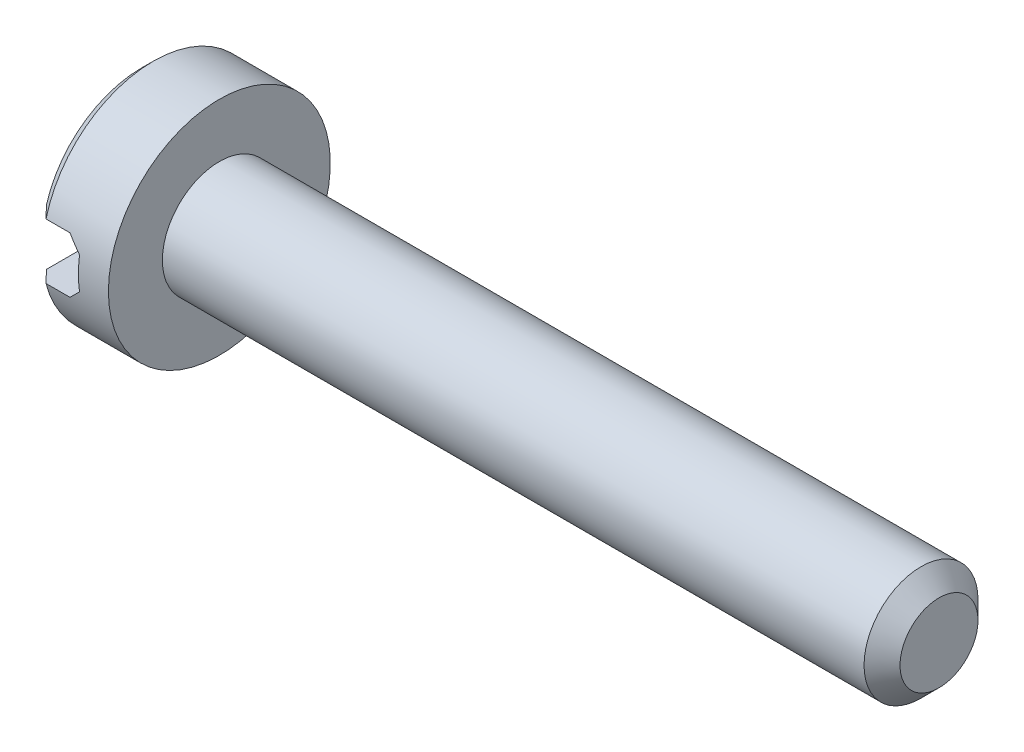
from build123d import *

# Parameters (mm, degrees)
ENL_V_MAT_EXTRU_1_DEPTH = 5
ESQUISSE3_R             = 0.95
EXTRUSION1_DEPTH        = 12
CHANFREIN1_SIZE         = 0.3


with BuildPart() as part:
    # Esquisse1 → R_volution1 (revolve)
    with BuildSketch(Plane.XY, mode=Mode.PRIVATE) as r_volution1_sk:
        Polygon((0, 0), (0, 1.65), (0.2, 1.85), (1.3, 1.85), (1.3, 0), align=None)
    revolve(r_volution1_sk.sketch.rotate(Axis((0, 0, 0), (1, 0, 0)), 90), axis=Axis((0, 0, 0), (1, 0, 0)))

    # Esquisse2 → Enl_v. mat.-Extru.1 (cut, symmetric)
    with BuildSketch(Plane.XY):
        Polygon((0, 0.465549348), (0.6, 0.465549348), (0.8, 0.265549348), (0.8, -0.265549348), (0.6, -0.465549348), (0, -0.465549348), align=None)
    extrude(amount=ENL_V_MAT_EXTRU_1_DEPTH, both=True, mode=Mode.SUBTRACT)

    # Esquisse3 → Extrusion1 (add)
    with BuildSketch(Plane(origin=(1.3, 0, 0), x_dir=(0, 0, -1), z_dir=(1, 0, 0))):
        with Locations(Location((0, 0, 0), (0, 0, 180))):
            Circle(ESQUISSE3_R)
    extrude(amount=EXTRUSION1_DEPTH)

    # Chanfrein1
    chanfrein1_edges = [part.edges().sort_by_distance(p)[0] for p in [
        (13.3, 0, -0.95),
    ]]
    chamfer(chanfrein1_edges, length=CHANFREIN1_SIZE)


solid = part.part
